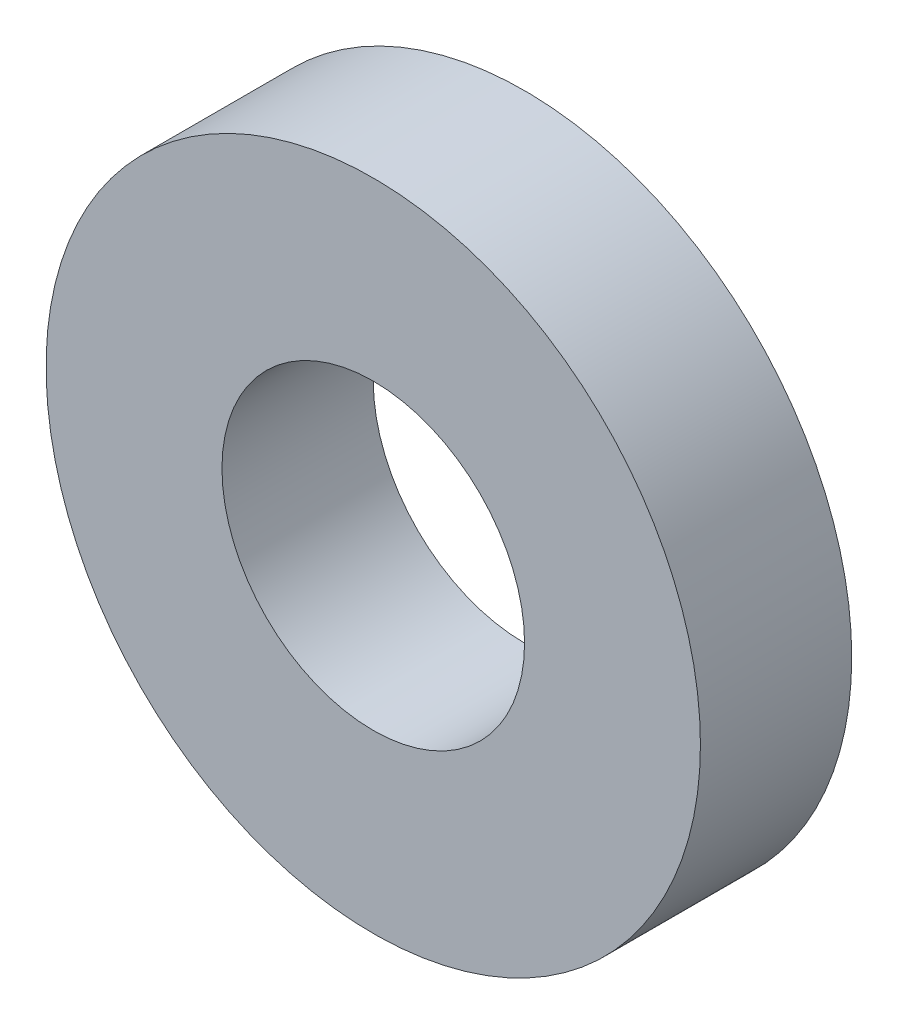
ISO-10303-21;
HEADER;
FILE_DESCRIPTION(('STEP AP214'),'2;1');
FILE_NAME('part.step','',(''),(''),'','','');
FILE_SCHEMA(('AUTOMOTIVE_DESIGN { 1 0 10303 214 1 1 1 1 }'));
ENDSEC;
DATA;
#1=APPLICATION_CONTEXT('core data for automotive mechanical design processes');
#2=APPLICATION_PROTOCOL_DEFINITION('international standard','automotive_design',2000,#1);
#3=PRODUCT_CONTEXT('',#1,'mechanical');
#4=PRODUCT('Part','Part','',(#3));
#5=PRODUCT_RELATED_PRODUCT_CATEGORY('part','',(#4));
#6=PRODUCT_DEFINITION_FORMATION('','',#4);
#7=PRODUCT_DEFINITION_CONTEXT('part definition',#1,'design');
#8=PRODUCT_DEFINITION('design','',#6,#7);
#9=PRODUCT_DEFINITION_SHAPE('','',#8);
#10=(LENGTH_UNIT() NAMED_UNIT(*) SI_UNIT(.MILLI.,.METRE.));
#11=(NAMED_UNIT(*) PLANE_ANGLE_UNIT() SI_UNIT($,.RADIAN.));
#12=(NAMED_UNIT(*) SI_UNIT($,.STERADIAN.) SOLID_ANGLE_UNIT());
#13=UNCERTAINTY_MEASURE_WITH_UNIT(LENGTH_MEASURE(1.E-05),#10,'distance_accuracy_value','');
#14=(GEOMETRIC_REPRESENTATION_CONTEXT(3) GLOBAL_UNCERTAINTY_ASSIGNED_CONTEXT((#13)) GLOBAL_UNIT_ASSIGNED_CONTEXT((#10,
#11,#12)) REPRESENTATION_CONTEXT('',''));
#15=CARTESIAN_POINT('',(0.,0.,0.));
#16=DIRECTION('',(0.,0.,1.));
#17=DIRECTION('',(1.,0.,0.));
#18=AXIS2_PLACEMENT_3D('',#15,#16,#17);
#19=CARTESIAN_POINT('',(-2.04003480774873E-12,1.11022302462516E-13,2.99999999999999));
#20=DIRECTION('',(0.,0.,1.));
#21=DIRECTION('',(1.,0.,0.));
#22=AXIS2_PLACEMENT_3D('',#19,#20,#21);
#23=PLANE('',#22);
#24=CARTESIAN_POINT('',(-2.04003480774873E-12,1.11022302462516E-13,2.99999999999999));
#25=DIRECTION('',(0.,0.,1.));
#26=DIRECTION('',(1.,0.,0.));
#27=AXIS2_PLACEMENT_3D('',#24,#25,#26);
#28=CIRCLE('',#27,12.975);
#29=CARTESIAN_POINT('',(12.974999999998,1.10842238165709E-13,2.99999999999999));
#30=VERTEX_POINT('',#29);
#31=EDGE_CURVE('E10',#30,#30,#28,.T.);
#32=ORIENTED_EDGE('',*,*,#31,.T.);
#33=EDGE_LOOP('',(#32));
#34=FACE_BOUND('',#33,.T.);
#35=CARTESIAN_POINT('',(-2.04003480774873E-12,1.11022302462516E-13,2.99999999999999));
#36=DIRECTION('',(0.,0.,1.));
#37=DIRECTION('',(1.,0.,0.));
#38=AXIS2_PLACEMENT_3D('',#35,#36,#37);
#39=CIRCLE('',#38,6.);
#40=CARTESIAN_POINT('',(5.99999999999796,1.10939035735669E-13,2.99999999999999));
#41=VERTEX_POINT('',#40);
#42=EDGE_CURVE('E37',#41,#41,#39,.T.);
#43=ORIENTED_EDGE('',*,*,#42,.F.);
#44=EDGE_LOOP('',(#43));
#45=FACE_BOUND('',#44,.T.);
#46=ADVANCED_FACE('F26',(#34,#45),#23,.T.);
#47=CARTESIAN_POINT('',(0.,0.,-3.));
#48=DIRECTION('',(0.,0.,1.));
#49=DIRECTION('',(1.,0.,0.));
#50=AXIS2_PLACEMENT_3D('',#47,#48,#49);
#51=PLANE('',#50);
#52=CARTESIAN_POINT('',(0.,0.,-3.));
#53=DIRECTION('',(0.,0.,1.));
#54=DIRECTION('',(1.,0.,0.));
#55=AXIS2_PLACEMENT_3D('',#52,#53,#54);
#56=CIRCLE('',#55,12.975);
#57=CARTESIAN_POINT('',(12.975,0.,-3.));
#58=VERTEX_POINT('',#57);
#59=EDGE_CURVE('E33',#58,#58,#56,.T.);
#60=ORIENTED_EDGE('',*,*,#59,.F.);
#61=EDGE_LOOP('',(#60));
#62=FACE_BOUND('',#61,.T.);
#63=CARTESIAN_POINT('',(0.,0.,-3.));
#64=DIRECTION('',(0.,0.,1.));
#65=DIRECTION('',(1.,0.,0.));
#66=AXIS2_PLACEMENT_3D('',#63,#64,#65);
#67=CIRCLE('',#66,6.);
#68=CARTESIAN_POINT('',(6.,0.,-3.));
#69=VERTEX_POINT('',#68);
#70=EDGE_CURVE('E41',#69,#69,#67,.T.);
#71=ORIENTED_EDGE('',*,*,#70,.T.);
#72=EDGE_LOOP('',(#71));
#73=FACE_BOUND('',#72,.T.);
#74=ADVANCED_FACE('F47',(#62,#73),#51,.F.);
#75=CARTESIAN_POINT('',(-2.04003480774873E-12,1.11022302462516E-13,2.99999999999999));
#76=DIRECTION('',(0.,0.,-1.));
#77=DIRECTION('',(-1.,0.,0.));
#78=AXIS2_PLACEMENT_3D('',#75,#76,#77);
#79=CYLINDRICAL_SURFACE('',#78,12.975);
#80=ORIENTED_EDGE('',*,*,#31,.F.);
#81=EDGE_LOOP('',(#80));
#82=FACE_BOUND('',#81,.T.);
#83=ORIENTED_EDGE('',*,*,#59,.T.);
#84=EDGE_LOOP('',(#83));
#85=FACE_BOUND('',#84,.T.);
#86=ADVANCED_FACE('F28',(#82,#85),#79,.T.);
#87=CARTESIAN_POINT('',(-2.04003480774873E-12,1.11022302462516E-13,2.99999999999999));
#88=DIRECTION('',(0.,0.,-1.));
#89=DIRECTION('',(-1.,0.,0.));
#90=AXIS2_PLACEMENT_3D('',#87,#88,#89);
#91=CYLINDRICAL_SURFACE('',#90,6.);
#92=ORIENTED_EDGE('',*,*,#42,.T.);
#93=EDGE_LOOP('',(#92));
#94=FACE_BOUND('',#93,.T.);
#95=ORIENTED_EDGE('',*,*,#70,.F.);
#96=EDGE_LOOP('',(#95));
#97=FACE_BOUND('',#96,.T.);
#98=ADVANCED_FACE('F49',(#94,#97),#91,.F.);
#99=CLOSED_SHELL('',(#46,#74,#86,#98));
#100=MANIFOLD_SOLID_BREP('B2',#99);
#101=ADVANCED_BREP_SHAPE_REPRESENTATION('',(#18,#100),#14);
#102=SHAPE_DEFINITION_REPRESENTATION(#9,#101);
ENDSEC;
END-ISO-10303-21;
